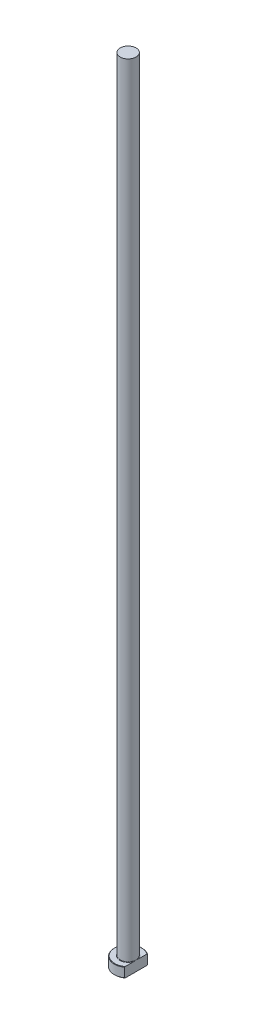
from build123d import *
from build123d.topology import SkipClean

# Parameters (mm, degrees)
CHAMFER1_SIZE = 0.2
FILLET1_R     = 0.2
KEY_DEPTH     = 401.122481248


with BuildPart() as part:
    # Sketch1 → Revolve1 (revolve)
    with BuildSketch(Plane.XY, mode=Mode.PRIVATE) as revolve1_sk:
        Polygon((0, 0), (-7, 0), (-7, 5), (-4, 5), (-4, 400), (0, 400), align=None)
    revolve(revolve1_sk.sketch.rotate(Axis((0, 259.958771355, 0), (0, -1, 0)), 270), axis=Axis((0, 259.958771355, 0), (0, -1, 0)))

    # Chamfer1
    chamfer1_edges = [part.edges().sort_by_distance(p)[0] for p in [
        (0, 5, -7),
        (0, 0, -7),
    ]]
    chamfer(chamfer1_edges, length=CHAMFER1_SIZE)

    # Fillet1
    fillet1_edges = [part.edges().sort_by_distance(p)[0] for p in [
        (0, 5, -4),
    ]]
    fillet(fillet1_edges, radius=FILLET1_R)

    # Sketch2 → KEY (cut, through all)
    with SkipClean():  # the faces are left unmerged after this step: merging them gives an invalid solid
        with BuildSketch(Plane(origin=(0, 0, 0), x_dir=(1, 0, 0), z_dir=(0, 1, 0))):
            with BuildLine():
                Line((4, 5.744562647), (4, -5.744562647))
                ThreePointArc((4, -5.744562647), (7, 0), (4, 5.744562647))
            make_face()
        extrude(amount=KEY_DEPTH, mode=Mode.SUBTRACT)


solid = part.part
